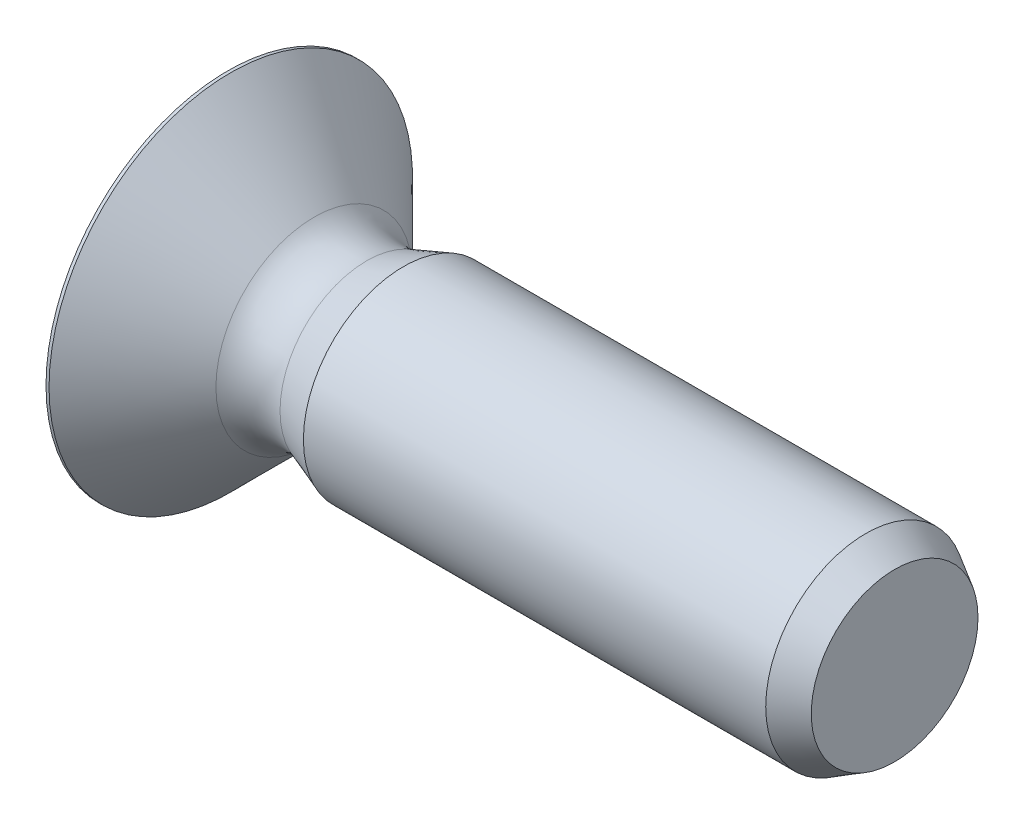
ISO-10303-21;
HEADER;
FILE_DESCRIPTION(('STEP AP214'),'2;1');
FILE_NAME('part.step','',(''),(''),'','','');
FILE_SCHEMA(('AUTOMOTIVE_DESIGN { 1 0 10303 214 1 1 1 1 }'));
ENDSEC;
DATA;
#1=APPLICATION_CONTEXT('core data for automotive mechanical design processes');
#2=APPLICATION_PROTOCOL_DEFINITION('international standard','automotive_design',2000,#1);
#3=PRODUCT_CONTEXT('',#1,'mechanical');
#4=PRODUCT('Part','Part','',(#3));
#5=PRODUCT_RELATED_PRODUCT_CATEGORY('part','',(#4));
#6=PRODUCT_DEFINITION_FORMATION('','',#4);
#7=PRODUCT_DEFINITION_CONTEXT('part definition',#1,'design');
#8=PRODUCT_DEFINITION('design','',#6,#7);
#9=PRODUCT_DEFINITION_SHAPE('','',#8);
#10=(LENGTH_UNIT() NAMED_UNIT(*) SI_UNIT(.MILLI.,.METRE.));
#11=(NAMED_UNIT(*) PLANE_ANGLE_UNIT() SI_UNIT($,.RADIAN.));
#12=(NAMED_UNIT(*) SI_UNIT($,.STERADIAN.) SOLID_ANGLE_UNIT());
#13=UNCERTAINTY_MEASURE_WITH_UNIT(LENGTH_MEASURE(1.E-05),#10,'distance_accuracy_value','');
#14=(GEOMETRIC_REPRESENTATION_CONTEXT(3) GLOBAL_UNCERTAINTY_ASSIGNED_CONTEXT((#13)) GLOBAL_UNIT_ASSIGNED_CONTEXT((#10,
#11,#12)) REPRESENTATION_CONTEXT('',''));
#15=CARTESIAN_POINT('',(0.,0.,0.));
#16=DIRECTION('',(0.,0.,1.));
#17=DIRECTION('',(1.,0.,0.));
#18=AXIS2_PLACEMENT_3D('',#15,#16,#17);
#19=CARTESIAN_POINT('',(-38.1054061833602,0.,0.));
#20=DIRECTION('',(-1.,0.,0.));
#21=DIRECTION('',(0.,0.,1.));
#22=AXIS2_PLACEMENT_3D('',#19,#20,#21);
#23=CYLINDRICAL_SURFACE('',#22,3.00000000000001);
#24=CARTESIAN_POINT('',(6.57794046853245,0.,0.));
#25=DIRECTION('',(-1.,0.,0.));
#26=DIRECTION('',(0.,0.,1.));
#27=AXIS2_PLACEMENT_3D('',#24,#25,#26);
#28=CIRCLE('',#27,3.);
#29=CARTESIAN_POINT('',(6.57794046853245,0.,3.));
#30=VERTEX_POINT('',#29);
#31=EDGE_CURVE('E178',#30,#30,#28,.T.);
#32=ORIENTED_EDGE('',*,*,#31,.F.);
#33=EDGE_LOOP('',(#32));
#34=FACE_BOUND('',#33,.T.);
#35=CARTESIAN_POINT('',(20.4429737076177,0.,0.));
#36=DIRECTION('',(1.,0.,0.));
#37=DIRECTION('',(0.,0.,-1.));
#38=AXIS2_PLACEMENT_3D('',#35,#36,#37);
#39=CIRCLE('',#38,3.);
#40=CARTESIAN_POINT('',(20.4429737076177,0.,-3.));
#41=VERTEX_POINT('',#40);
#42=EDGE_CURVE('E224',#41,#41,#39,.T.);
#43=ORIENTED_EDGE('',*,*,#42,.F.);
#44=EDGE_LOOP('',(#43));
#45=FACE_BOUND('',#44,.T.);
#46=ADVANCED_FACE('F47',(#34,#45),#23,.T.);
#47=CARTESIAN_POINT('',(6.57794046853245,0.,0.));
#48=DIRECTION('',(1.,0.,0.));
#49=DIRECTION('',(0.,0.,-1.));
#50=AXIS2_PLACEMENT_3D('',#47,#48,#49);
#51=CONICAL_SURFACE('',#50,3.,0.349065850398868);
#52=CARTESIAN_POINT('',(5.47591580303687,0.,0.));
#53=DIRECTION('',(1.,0.,0.));
#54=DIRECTION('',(0.,0.,-1.));
#55=AXIS2_PLACEMENT_3D('',#52,#53,#54);
#56=CIRCLE('',#55,2.59889582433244);
#57=CARTESIAN_POINT('',(5.47591580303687,0.,-2.59889582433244));
#58=VERTEX_POINT('',#57);
#59=EDGE_CURVE('E11',#58,#58,#56,.T.);
#60=ORIENTED_EDGE('',*,*,#59,.T.);
#61=EDGE_LOOP('',(#60));
#62=FACE_BOUND('',#61,.T.);
#63=ORIENTED_EDGE('',*,*,#31,.T.);
#64=EDGE_LOOP('',(#63));
#65=FACE_BOUND('',#64,.T.);
#66=ADVANCED_FACE('F249',(#62,#65),#51,.T.);
#67=CARTESIAN_POINT('',(4.57794046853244,0.,0.));
#68=DIRECTION('',(-1.,0.,0.));
#69=DIRECTION('',(0.,0.,1.));
#70=AXIS2_PLACEMENT_3D('',#67,#68,#69);
#71=CONICAL_SURFACE('',#70,2.27205953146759,0.785398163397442);
#72=CARTESIAN_POINT('',(3.90222541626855,0.,0.));
#73=DIRECTION('',(-1.,0.,0.));
#74=DIRECTION('',(0.,0.,1.));
#75=AXIS2_PLACEMENT_3D('',#72,#73,#74);
#76=CIRCLE('',#75,2.94777458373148);
#77=CARTESIAN_POINT('',(3.90222541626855,0.,2.94777458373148));
#78=VERTEX_POINT('',#77);
#79=EDGE_CURVE('E56',#78,#78,#76,.T.);
#80=ORIENTED_EDGE('',*,*,#79,.T.);
#81=EDGE_LOOP('',(#80));
#82=FACE_BOUND('',#81,.T.);
#83=CARTESIAN_POINT('',(1.4,0.,0.));
#84=DIRECTION('',(-1.,0.,0.));
#85=DIRECTION('',(0.,0.,1.));
#86=AXIS2_PLACEMENT_3D('',#83,#84,#85);
#87=CIRCLE('',#86,5.45);
#88=CARTESIAN_POINT('',(1.4,0.,5.45));
#89=VERTEX_POINT('',#88);
#90=EDGE_CURVE('E324',#89,#89,#87,.T.);
#91=ORIENTED_EDGE('',*,*,#90,.F.);
#92=EDGE_LOOP('',(#91));
#93=FACE_BOUND('',#92,.T.);
#94=ADVANCED_FACE('F234',(#82,#93),#71,.T.);
#95=CARTESIAN_POINT('',(-38.1054061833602,0.,0.));
#96=DIRECTION('',(-1.,0.,0.));
#97=DIRECTION('',(0.,0.,1.));
#98=AXIS2_PLACEMENT_3D('',#95,#96,#97);
#99=CYLINDRICAL_SURFACE('',#98,5.45);
#100=CARTESIAN_POINT('',(1.30899911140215,0.,0.));
#101=DIRECTION('',(-1.,0.,0.));
#102=DIRECTION('',(0.,0.,1.));
#103=AXIS2_PLACEMENT_3D('',#100,#101,#102);
#104=CIRCLE('',#103,5.45);
#105=CARTESIAN_POINT('',(1.30899911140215,0.,5.45));
#106=VERTEX_POINT('',#105);
#107=EDGE_CURVE('E321',#106,#106,#104,.T.);
#108=ORIENTED_EDGE('',*,*,#107,.F.);
#109=EDGE_LOOP('',(#108));
#110=FACE_BOUND('',#109,.T.);
#111=ORIENTED_EDGE('',*,*,#90,.T.);
#112=EDGE_LOOP('',(#111));
#113=FACE_BOUND('',#112,.T.);
#114=ADVANCED_FACE('F333',(#110,#113),#99,.T.);
#115=CARTESIAN_POINT('',(12.,0.,0.));
#116=DIRECTION('',(-1.,0.,0.));
#117=DIRECTION('',(0.,1.,0.));
#118=AXIS2_PLACEMENT_3D('',#115,#116,#117);
#119=SPHERICAL_SURFACE('',#118,12.);
#120=CARTESIAN_POINT('',(12.,0.729999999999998,0.));
#121=DIRECTION('',(0.,1.,0.));
#122=DIRECTION('',(0.,0.,1.));
#123=AXIS2_PLACEMENT_3D('',#120,#121,#122);
#124=CIRCLE('',#123,11.977775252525);
#125=CARTESIAN_POINT('',(0.455948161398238,0.729999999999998,-3.19405183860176));
#126=VERTEX_POINT('',#125);
#127=CARTESIAN_POINT('',(0.0444908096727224,0.729999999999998,-0.73));
#128=VERTEX_POINT('',#127);
#129=EDGE_CURVE('E177',#126,#128,#124,.T.);
#130=ORIENTED_EDGE('',*,*,#129,.T.);
#131=CARTESIAN_POINT('',(12.,0.,-0.73));
#132=DIRECTION('',(0.,0.,-1.));
#133=DIRECTION('',(0.,1.,0.));
#134=AXIS2_PLACEMENT_3D('',#131,#132,#133);
#135=CIRCLE('',#134,11.977775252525);
#136=CARTESIAN_POINT('',(0.455948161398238,3.19405183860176,-0.729999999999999));
#137=VERTEX_POINT('',#136);
#138=EDGE_CURVE('E182',#128,#137,#135,.T.);
#139=ORIENTED_EDGE('',*,*,#138,.T.);
#140=CARTESIAN_POINT('',(7.82499999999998,-4.17500000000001,0.));
#141=DIRECTION('',(-0.707106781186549,-0.707106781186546,0.));
#142=DIRECTION('',(0.707106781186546,-0.707106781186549,0.));
#143=AXIS2_PLACEMENT_3D('',#140,#141,#142);
#144=CIRCLE('',#143,10.44694931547);
#145=CARTESIAN_POINT('',(0.455948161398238,3.19405183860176,0.729999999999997));
#146=VERTEX_POINT('',#145);
#147=EDGE_CURVE('E185',#137,#146,#144,.F.);
#148=ORIENTED_EDGE('',*,*,#147,.T.);
#149=CARTESIAN_POINT('',(12.,0.,0.73));
#150=DIRECTION('',(0.,0.,1.));
#151=DIRECTION('',(0.,-1.,0.));
#152=AXIS2_PLACEMENT_3D('',#149,#150,#151);
#153=CIRCLE('',#152,11.977775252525);
#154=CARTESIAN_POINT('',(0.0444908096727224,0.729999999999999,0.73));
#155=VERTEX_POINT('',#154);
#156=EDGE_CURVE('E186',#146,#155,#153,.T.);
#157=ORIENTED_EDGE('',*,*,#156,.T.);
#158=CARTESIAN_POINT('',(12.,0.729999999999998,0.));
#159=DIRECTION('',(0.,1.,0.));
#160=DIRECTION('',(0.,0.,1.));
#161=AXIS2_PLACEMENT_3D('',#158,#159,#160);
#162=CIRCLE('',#161,11.977775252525);
#163=CARTESIAN_POINT('',(0.45594816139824,0.729999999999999,3.19405183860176));
#164=VERTEX_POINT('',#163);
#165=EDGE_CURVE('E167',#155,#164,#162,.T.);
#166=ORIENTED_EDGE('',*,*,#165,.T.);
#167=CARTESIAN_POINT('',(7.82499999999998,0.,-4.17500000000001));
#168=DIRECTION('',(-0.707106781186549,0.,-0.707106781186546));
#169=DIRECTION('',(-0.707106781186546,0.,0.707106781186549));
#170=AXIS2_PLACEMENT_3D('',#167,#168,#169);
#171=CIRCLE('',#170,10.44694931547);
#172=CARTESIAN_POINT('',(0.455948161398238,-0.729999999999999,3.19405183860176));
#173=VERTEX_POINT('',#172);
#174=EDGE_CURVE('E165',#164,#173,#171,.F.);
#175=ORIENTED_EDGE('',*,*,#174,.T.);
#176=CARTESIAN_POINT('',(12.,-0.729999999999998,0.));
#177=DIRECTION('',(0.,-1.,0.));
#178=DIRECTION('',(0.,0.,-1.));
#179=AXIS2_PLACEMENT_3D('',#176,#177,#178);
#180=CIRCLE('',#179,11.977775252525);
#181=CARTESIAN_POINT('',(0.0444908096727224,-0.729999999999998,0.73));
#182=VERTEX_POINT('',#181);
#183=EDGE_CURVE('E149',#173,#182,#180,.T.);
#184=ORIENTED_EDGE('',*,*,#183,.T.);
#185=CARTESIAN_POINT('',(12.,0.,0.73));
#186=DIRECTION('',(0.,0.,1.));
#187=DIRECTION('',(0.,-1.,0.));
#188=AXIS2_PLACEMENT_3D('',#185,#186,#187);
#189=CIRCLE('',#188,11.977775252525);
#190=CARTESIAN_POINT('',(0.455948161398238,-3.19405183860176,0.729999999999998));
#191=VERTEX_POINT('',#190);
#192=EDGE_CURVE('E139',#182,#191,#189,.T.);
#193=ORIENTED_EDGE('',*,*,#192,.T.);
#194=CARTESIAN_POINT('',(7.82499999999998,4.17500000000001,0.));
#195=DIRECTION('',(-0.707106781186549,0.707106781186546,0.));
#196=DIRECTION('',(-0.707106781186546,-0.707106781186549,0.));
#197=AXIS2_PLACEMENT_3D('',#194,#195,#196);
#198=CIRCLE('',#197,10.44694931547);
#199=CARTESIAN_POINT('',(0.455948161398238,-3.19405183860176,-0.729999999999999));
#200=VERTEX_POINT('',#199);
#201=EDGE_CURVE('E150',#191,#200,#198,.F.);
#202=ORIENTED_EDGE('',*,*,#201,.T.);
#203=CARTESIAN_POINT('',(12.,0.,-0.73));
#204=DIRECTION('',(0.,0.,-1.));
#205=DIRECTION('',(0.,1.,0.));
#206=AXIS2_PLACEMENT_3D('',#203,#204,#205);
#207=CIRCLE('',#206,11.977775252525);
#208=CARTESIAN_POINT('',(0.0444908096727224,-0.729999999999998,-0.73));
#209=VERTEX_POINT('',#208);
#210=EDGE_CURVE('E175',#200,#209,#207,.T.);
#211=ORIENTED_EDGE('',*,*,#210,.T.);
#212=CARTESIAN_POINT('',(12.,-0.729999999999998,0.));
#213=DIRECTION('',(0.,-1.,0.));
#214=DIRECTION('',(0.,0.,-1.));
#215=AXIS2_PLACEMENT_3D('',#212,#213,#214);
#216=CIRCLE('',#215,11.977775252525);
#217=CARTESIAN_POINT('',(0.455948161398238,-0.729999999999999,-3.19405183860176));
#218=VERTEX_POINT('',#217);
#219=EDGE_CURVE('E172',#209,#218,#216,.T.);
#220=ORIENTED_EDGE('',*,*,#219,.T.);
#221=CARTESIAN_POINT('',(7.82499999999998,0.,4.17500000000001));
#222=DIRECTION('',(-0.707106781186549,0.,0.707106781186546));
#223=DIRECTION('',(0.707106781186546,0.,0.707106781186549));
#224=AXIS2_PLACEMENT_3D('',#221,#222,#223);
#225=CIRCLE('',#224,10.44694931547);
#226=EDGE_CURVE('E176',#218,#126,#225,.F.);
#227=ORIENTED_EDGE('',*,*,#226,.T.);
#228=EDGE_LOOP('',(#130,#139,#148,#157,#166,#175,#184,#193,#202,#211,#220,#227));
#229=FACE_BOUND('',#228,.T.);
#230=ORIENTED_EDGE('',*,*,#107,.T.);
#231=EDGE_LOOP('',(#230));
#232=FACE_BOUND('',#231,.T.);
#233=ADVANCED_FACE('F162',(#229,#232),#119,.T.);
#234=CARTESIAN_POINT('',(21.3089991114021,0.,0.));
#235=DIRECTION('',(-1.,0.,0.));
#236=DIRECTION('',(0.,0.,1.));
#237=AXIS2_PLACEMENT_3D('',#234,#235,#236);
#238=CONICAL_SURFACE('',#237,2.5,0.523598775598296);
#239=ORIENTED_EDGE('',*,*,#42,.T.);
#240=EDGE_LOOP('',(#239));
#241=FACE_BOUND('',#240,.T.);
#242=CARTESIAN_POINT('',(21.3089991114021,0.,0.));
#243=DIRECTION('',(1.,0.,0.));
#244=DIRECTION('',(0.,0.,-1.));
#245=AXIS2_PLACEMENT_3D('',#242,#243,#244);
#246=CIRCLE('',#245,2.5);
#247=CARTESIAN_POINT('',(21.3089991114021,0.,-2.5));
#248=VERTEX_POINT('',#247);
#249=EDGE_CURVE('E318',#248,#248,#246,.T.);
#250=ORIENTED_EDGE('',*,*,#249,.F.);
#251=EDGE_LOOP('',(#250));
#252=FACE_BOUND('',#251,.T.);
#253=ADVANCED_FACE('F265',(#241,#252),#238,.T.);
#254=CARTESIAN_POINT('',(21.3089991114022,0.,0.));
#255=DIRECTION('',(-1.,0.,0.));
#256=DIRECTION('',(0.,0.,1.));
#257=AXIS2_PLACEMENT_3D('',#254,#255,#256);
#258=PLANE('',#257);
#259=ORIENTED_EDGE('',*,*,#249,.T.);
#260=EDGE_LOOP('',(#259));
#261=FACE_BOUND('',#260,.T.);
#262=ADVANCED_FACE('F261',(#261),#258,.F.);
#263=CARTESIAN_POINT('',(2.725,3.65,-0.729999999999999));
#264=DIRECTION('',(0.,0.,-1.));
#265=DIRECTION('',(0.,1.,0.));
#266=AXIS2_PLACEMENT_3D('',#263,#264,#265);
#267=PLANE('',#266);
#268=DIRECTION('',(-1.,0.,0.));
#269=VECTOR('',#268,1.);
#270=CARTESIAN_POINT('',(2.725,0.729999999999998,-0.73));
#271=LINE('',#270,#269);
#272=CARTESIAN_POINT('',(2.725,0.729999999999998,-0.73));
#273=VERTEX_POINT('',#272);
#274=EDGE_CURVE('E64',#273,#128,#271,.T.);
#275=ORIENTED_EDGE('',*,*,#274,.F.);
#276=DIRECTION('',(0.,-1.,0.));
#277=VECTOR('',#276,1.);
#278=CARTESIAN_POINT('',(2.725,3.65,-0.729999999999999));
#279=LINE('',#278,#277);
#280=CARTESIAN_POINT('',(2.725,0.92499999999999,-0.73));
#281=VERTEX_POINT('',#280);
#282=EDGE_CURVE('E303',#281,#273,#279,.T.);
#283=ORIENTED_EDGE('',*,*,#282,.F.);
#284=DIRECTION('',(0.707106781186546,-0.707106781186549,0.));
#285=VECTOR('',#284,1.);
#286=CARTESIAN_POINT('',(0.,3.65,-0.729999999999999));
#287=LINE('',#286,#285);
#288=EDGE_CURVE('E221',#281,#137,#287,.F.);
#289=ORIENTED_EDGE('',*,*,#288,.T.);
#290=ORIENTED_EDGE('',*,*,#138,.F.);
#291=EDGE_LOOP('',(#275,#283,#289,#290));
#292=FACE_BOUND('',#291,.T.);
#293=ADVANCED_FACE('F264',(#292),#267,.F.);
#294=CARTESIAN_POINT('',(0.,3.65,0.));
#295=DIRECTION('',(-0.707106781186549,-0.707106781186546,0.));
#296=DIRECTION('',(0.707106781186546,-0.707106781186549,0.));
#297=AXIS2_PLACEMENT_3D('',#294,#295,#296);
#298=PLANE('',#297);
#299=ORIENTED_EDGE('',*,*,#288,.F.);
#300=DIRECTION('',(0.,0.,1.));
#301=VECTOR('',#300,1.);
#302=CARTESIAN_POINT('',(2.725,0.92499999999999,-0.730000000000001));
#303=LINE('',#302,#301);
#304=CARTESIAN_POINT('',(2.725,0.924999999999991,0.729999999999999));
#305=VERTEX_POINT('',#304);
#306=EDGE_CURVE('E228',#305,#281,#303,.F.);
#307=ORIENTED_EDGE('',*,*,#306,.F.);
#308=DIRECTION('',(0.707106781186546,-0.707106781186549,0.));
#309=VECTOR('',#308,1.);
#310=CARTESIAN_POINT('',(1.3625,2.2875,0.729999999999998));
#311=LINE('',#310,#309);
#312=EDGE_CURVE('E120',#305,#146,#311,.F.);
#313=ORIENTED_EDGE('',*,*,#312,.T.);
#314=ORIENTED_EDGE('',*,*,#147,.F.);
#315=EDGE_LOOP('',(#299,#307,#313,#314));
#316=FACE_BOUND('',#315,.T.);
#317=ADVANCED_FACE('F272',(#316),#298,.T.);
#318=CARTESIAN_POINT('',(2.725,3.65,0.729999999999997));
#319=DIRECTION('',(0.,0.,1.));
#320=DIRECTION('',(0.,-1.,0.));
#321=AXIS2_PLACEMENT_3D('',#318,#319,#320);
#322=PLANE('',#321);
#323=ORIENTED_EDGE('',*,*,#312,.F.);
#324=DIRECTION('',(0.,1.,0.));
#325=VECTOR('',#324,1.);
#326=CARTESIAN_POINT('',(2.725,3.65,0.729999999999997));
#327=LINE('',#326,#325);
#328=CARTESIAN_POINT('',(2.725,0.729999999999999,0.73));
#329=VERTEX_POINT('',#328);
#330=EDGE_CURVE('E230',#329,#305,#327,.T.);
#331=ORIENTED_EDGE('',*,*,#330,.F.);
#332=DIRECTION('',(-1.,0.,0.));
#333=VECTOR('',#332,1.);
#334=CARTESIAN_POINT('',(2.725,0.729999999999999,0.73));
#335=LINE('',#334,#333);
#336=EDGE_CURVE('E129',#329,#155,#335,.T.);
#337=ORIENTED_EDGE('',*,*,#336,.T.);
#338=ORIENTED_EDGE('',*,*,#156,.F.);
#339=EDGE_LOOP('',(#323,#331,#337,#338));
#340=FACE_BOUND('',#339,.T.);
#341=ADVANCED_FACE('F275',(#340),#322,.F.);
#342=CARTESIAN_POINT('',(2.725,0.729999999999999,0.73));
#343=DIRECTION('',(0.,1.,0.));
#344=DIRECTION('',(0.,0.,1.));
#345=AXIS2_PLACEMENT_3D('',#342,#343,#344);
#346=PLANE('',#345);
#347=ORIENTED_EDGE('',*,*,#336,.F.);
#348=DIRECTION('',(0.,0.,-1.));
#349=VECTOR('',#348,1.);
#350=CARTESIAN_POINT('',(2.725,0.729999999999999,0.73));
#351=LINE('',#350,#349);
#352=CARTESIAN_POINT('',(2.725,0.729999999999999,0.924999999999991));
#353=VERTEX_POINT('',#352);
#354=EDGE_CURVE('E196',#353,#329,#351,.T.);
#355=ORIENTED_EDGE('',*,*,#354,.F.);
#356=DIRECTION('',(0.707106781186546,0.,-0.707106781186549));
#357=VECTOR('',#356,1.);
#358=CARTESIAN_POINT('',(0.,0.73,3.65));
#359=LINE('',#358,#357);
#360=EDGE_CURVE('E189',#353,#164,#359,.F.);
#361=ORIENTED_EDGE('',*,*,#360,.T.);
#362=ORIENTED_EDGE('',*,*,#165,.F.);
#363=EDGE_LOOP('',(#347,#355,#361,#362));
#364=FACE_BOUND('',#363,.T.);
#365=ADVANCED_FACE('F270',(#364),#346,.F.);
#366=CARTESIAN_POINT('',(0.,0.,3.65));
#367=DIRECTION('',(-0.707106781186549,0.,-0.707106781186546));
#368=DIRECTION('',(-0.707106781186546,0.,0.707106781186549));
#369=AXIS2_PLACEMENT_3D('',#366,#367,#368);
#370=PLANE('',#369);
#371=ORIENTED_EDGE('',*,*,#360,.F.);
#372=DIRECTION('',(0.,-1.,0.));
#373=VECTOR('',#372,1.);
#374=CARTESIAN_POINT('',(2.725,-0.729999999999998,0.924999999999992));
#375=LINE('',#374,#373);
#376=CARTESIAN_POINT('',(2.725,-0.729999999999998,0.924999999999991));
#377=VERTEX_POINT('',#376);
#378=EDGE_CURVE('E193',#377,#353,#375,.F.);
#379=ORIENTED_EDGE('',*,*,#378,.F.);
#380=DIRECTION('',(0.707106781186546,0.,-0.707106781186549));
#381=VECTOR('',#380,1.);
#382=CARTESIAN_POINT('',(2.8225,-0.729999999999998,0.827499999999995));
#383=LINE('',#382,#381);
#384=EDGE_CURVE('E158',#377,#173,#383,.F.);
#385=ORIENTED_EDGE('',*,*,#384,.T.);
#386=ORIENTED_EDGE('',*,*,#174,.F.);
#387=EDGE_LOOP('',(#371,#379,#385,#386));
#388=FACE_BOUND('',#387,.T.);
#389=ADVANCED_FACE('F267',(#388),#370,.T.);
#390=CARTESIAN_POINT('',(2.725,-0.729999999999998,0.73));
#391=DIRECTION('',(0.,-1.,0.));
#392=DIRECTION('',(0.,0.,-1.));
#393=AXIS2_PLACEMENT_3D('',#390,#391,#392);
#394=PLANE('',#393);
#395=ORIENTED_EDGE('',*,*,#384,.F.);
#396=DIRECTION('',(0.,0.,1.));
#397=VECTOR('',#396,1.);
#398=CARTESIAN_POINT('',(2.725,-0.729999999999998,0.73));
#399=LINE('',#398,#397);
#400=CARTESIAN_POINT('',(2.725,-0.729999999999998,0.73));
#401=VERTEX_POINT('',#400);
#402=EDGE_CURVE('E156',#401,#377,#399,.T.);
#403=ORIENTED_EDGE('',*,*,#402,.F.);
#404=DIRECTION('',(-1.,0.,0.));
#405=VECTOR('',#404,1.);
#406=CARTESIAN_POINT('',(2.725,-0.729999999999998,0.73));
#407=LINE('',#406,#405);
#408=EDGE_CURVE('E143',#401,#182,#407,.T.);
#409=ORIENTED_EDGE('',*,*,#408,.T.);
#410=ORIENTED_EDGE('',*,*,#183,.F.);
#411=EDGE_LOOP('',(#395,#403,#409,#410));
#412=FACE_BOUND('',#411,.T.);
#413=ADVANCED_FACE('F153',(#412),#394,.F.);
#414=CARTESIAN_POINT('',(2.725,-3.65,0.729999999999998));
#415=DIRECTION('',(0.,0.,1.));
#416=DIRECTION('',(0.,-1.,0.));
#417=AXIS2_PLACEMENT_3D('',#414,#415,#416);
#418=PLANE('',#417);
#419=ORIENTED_EDGE('',*,*,#408,.F.);
#420=DIRECTION('',(0.,1.,0.));
#421=VECTOR('',#420,1.);
#422=CARTESIAN_POINT('',(2.725,-3.65,0.729999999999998));
#423=LINE('',#422,#421);
#424=CARTESIAN_POINT('',(2.725,-0.92499999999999,0.73));
#425=VERTEX_POINT('',#424);
#426=EDGE_CURVE('E219',#425,#401,#423,.T.);
#427=ORIENTED_EDGE('',*,*,#426,.F.);
#428=DIRECTION('',(0.707106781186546,0.707106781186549,0.));
#429=VECTOR('',#428,1.);
#430=CARTESIAN_POINT('',(0.,-3.65,0.729999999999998));
#431=LINE('',#430,#429);
#432=EDGE_CURVE('E145',#425,#191,#431,.F.);
#433=ORIENTED_EDGE('',*,*,#432,.T.);
#434=ORIENTED_EDGE('',*,*,#192,.F.);
#435=EDGE_LOOP('',(#419,#427,#433,#434));
#436=FACE_BOUND('',#435,.T.);
#437=ADVANCED_FACE('F141',(#436),#418,.F.);
#438=CARTESIAN_POINT('',(0.,-3.65,0.));
#439=DIRECTION('',(-0.707106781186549,0.707106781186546,0.));
#440=DIRECTION('',(-0.707106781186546,-0.707106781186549,0.));
#441=AXIS2_PLACEMENT_3D('',#438,#439,#440);
#442=PLANE('',#441);
#443=ORIENTED_EDGE('',*,*,#432,.F.);
#444=DIRECTION('',(0.,0.,-1.));
#445=VECTOR('',#444,1.);
#446=CARTESIAN_POINT('',(2.725,-0.924999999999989,-0.73));
#447=LINE('',#446,#445);
#448=CARTESIAN_POINT('',(2.725,-0.924999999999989,-0.73));
#449=VERTEX_POINT('',#448);
#450=EDGE_CURVE('E216',#449,#425,#447,.F.);
#451=ORIENTED_EDGE('',*,*,#450,.F.);
#452=DIRECTION('',(0.707106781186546,0.707106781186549,0.));
#453=VECTOR('',#452,1.);
#454=CARTESIAN_POINT('',(1.36249999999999,-2.2875,-0.729999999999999));
#455=LINE('',#454,#453);
#456=EDGE_CURVE('E212',#449,#200,#455,.F.);
#457=ORIENTED_EDGE('',*,*,#456,.T.);
#458=ORIENTED_EDGE('',*,*,#201,.F.);
#459=EDGE_LOOP('',(#443,#451,#457,#458));
#460=FACE_BOUND('',#459,.T.);
#461=ADVANCED_FACE('F277',(#460),#442,.T.);
#462=CARTESIAN_POINT('',(2.725,-3.65,-0.729999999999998));
#463=DIRECTION('',(0.,0.,-1.));
#464=DIRECTION('',(0.,1.,0.));
#465=AXIS2_PLACEMENT_3D('',#462,#463,#464);
#466=PLANE('',#465);
#467=ORIENTED_EDGE('',*,*,#456,.F.);
#468=DIRECTION('',(0.,-1.,0.));
#469=VECTOR('',#468,1.);
#470=CARTESIAN_POINT('',(2.725,-3.65,-0.729999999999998));
#471=LINE('',#470,#469);
#472=CARTESIAN_POINT('',(2.725,-0.729999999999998,-0.73));
#473=VERTEX_POINT('',#472);
#474=EDGE_CURVE('E220',#473,#449,#471,.T.);
#475=ORIENTED_EDGE('',*,*,#474,.F.);
#476=DIRECTION('',(-1.,0.,0.));
#477=VECTOR('',#476,1.);
#478=CARTESIAN_POINT('',(2.725,-0.729999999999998,-0.73));
#479=LINE('',#478,#477);
#480=EDGE_CURVE('E200',#473,#209,#479,.T.);
#481=ORIENTED_EDGE('',*,*,#480,.T.);
#482=ORIENTED_EDGE('',*,*,#210,.F.);
#483=EDGE_LOOP('',(#467,#475,#481,#482));
#484=FACE_BOUND('',#483,.T.);
#485=ADVANCED_FACE('F279',(#484),#466,.F.);
#486=CARTESIAN_POINT('',(2.725,-0.729999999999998,-0.73));
#487=DIRECTION('',(0.,-1.,0.));
#488=DIRECTION('',(0.,0.,-1.));
#489=AXIS2_PLACEMENT_3D('',#486,#487,#488);
#490=PLANE('',#489);
#491=ORIENTED_EDGE('',*,*,#480,.F.);
#492=DIRECTION('',(0.,0.,1.));
#493=VECTOR('',#492,1.);
#494=CARTESIAN_POINT('',(2.725,-0.729999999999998,-0.73));
#495=LINE('',#494,#493);
#496=CARTESIAN_POINT('',(2.725,-0.729999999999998,-0.924999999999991));
#497=VERTEX_POINT('',#496);
#498=EDGE_CURVE('E209',#497,#473,#495,.T.);
#499=ORIENTED_EDGE('',*,*,#498,.F.);
#500=DIRECTION('',(0.707106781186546,0.,0.707106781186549));
#501=VECTOR('',#500,1.);
#502=CARTESIAN_POINT('',(0.,-0.729999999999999,-3.65));
#503=LINE('',#502,#501);
#504=EDGE_CURVE('E197',#497,#218,#503,.F.);
#505=ORIENTED_EDGE('',*,*,#504,.T.);
#506=ORIENTED_EDGE('',*,*,#219,.F.);
#507=EDGE_LOOP('',(#491,#499,#505,#506));
#508=FACE_BOUND('',#507,.T.);
#509=ADVANCED_FACE('F283',(#508),#490,.F.);
#510=CARTESIAN_POINT('',(0.,0.,-3.65));
#511=DIRECTION('',(-0.707106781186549,0.,0.707106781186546));
#512=DIRECTION('',(0.707106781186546,0.,0.707106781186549));
#513=AXIS2_PLACEMENT_3D('',#510,#511,#512);
#514=PLANE('',#513);
#515=ORIENTED_EDGE('',*,*,#504,.F.);
#516=DIRECTION('',(0.,1.,0.));
#517=VECTOR('',#516,1.);
#518=CARTESIAN_POINT('',(2.725,-0.729999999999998,-0.924999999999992));
#519=LINE('',#518,#517);
#520=CARTESIAN_POINT('',(2.725,0.729999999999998,-0.924999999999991));
#521=VERTEX_POINT('',#520);
#522=EDGE_CURVE('E206',#521,#497,#519,.F.);
#523=ORIENTED_EDGE('',*,*,#522,.F.);
#524=DIRECTION('',(0.707106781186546,0.,0.707106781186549));
#525=VECTOR('',#524,1.);
#526=CARTESIAN_POINT('',(2.8225,0.729999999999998,-0.827499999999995));
#527=LINE('',#526,#525);
#528=EDGE_CURVE('E201',#521,#126,#527,.F.);
#529=ORIENTED_EDGE('',*,*,#528,.T.);
#530=ORIENTED_EDGE('',*,*,#226,.F.);
#531=EDGE_LOOP('',(#515,#523,#529,#530));
#532=FACE_BOUND('',#531,.T.);
#533=ADVANCED_FACE('F281',(#532),#514,.T.);
#534=CARTESIAN_POINT('',(2.725,0.729999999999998,-0.73));
#535=DIRECTION('',(0.,1.,0.));
#536=DIRECTION('',(0.,0.,1.));
#537=AXIS2_PLACEMENT_3D('',#534,#535,#536);
#538=PLANE('',#537);
#539=ORIENTED_EDGE('',*,*,#528,.F.);
#540=DIRECTION('',(0.,0.,-1.));
#541=VECTOR('',#540,1.);
#542=CARTESIAN_POINT('',(2.725,0.729999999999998,-0.73));
#543=LINE('',#542,#541);
#544=EDGE_CURVE('E210',#273,#521,#543,.T.);
#545=ORIENTED_EDGE('',*,*,#544,.F.);
#546=ORIENTED_EDGE('',*,*,#274,.T.);
#547=ORIENTED_EDGE('',*,*,#129,.F.);
#548=EDGE_LOOP('',(#539,#545,#546,#547));
#549=FACE_BOUND('',#548,.T.);
#550=ADVANCED_FACE('F244',(#549),#538,.F.);
#551=CARTESIAN_POINT('',(2.725,-0.729999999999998,-0.73));
#552=DIRECTION('',(-1.,0.,0.));
#553=DIRECTION('',(0.,0.,1.));
#554=AXIS2_PLACEMENT_3D('',#551,#552,#553);
#555=PLANE('',#554);
#556=ORIENTED_EDGE('',*,*,#282,.T.);
#557=ORIENTED_EDGE('',*,*,#544,.T.);
#558=ORIENTED_EDGE('',*,*,#522,.T.);
#559=ORIENTED_EDGE('',*,*,#498,.T.);
#560=ORIENTED_EDGE('',*,*,#474,.T.);
#561=ORIENTED_EDGE('',*,*,#450,.T.);
#562=ORIENTED_EDGE('',*,*,#426,.T.);
#563=ORIENTED_EDGE('',*,*,#402,.T.);
#564=ORIENTED_EDGE('',*,*,#378,.T.);
#565=ORIENTED_EDGE('',*,*,#354,.T.);
#566=ORIENTED_EDGE('',*,*,#330,.T.);
#567=ORIENTED_EDGE('',*,*,#306,.T.);
#568=EDGE_LOOP('',(#556,#557,#558,#559,#560,#561,#562,#563,#564,#565,#566,#567));
#569=FACE_BOUND('',#568,.T.);
#570=ADVANCED_FACE('F238',(#569),#555,.T.);
#571=CARTESIAN_POINT('',(4.96288558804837,0.,0.));
#572=DIRECTION('',(-1.,0.,0.));
#573=DIRECTION('',(0.,0.,1.));
#574=AXIS2_PLACEMENT_3D('',#571,#572,#573);
#575=TOROIDAL_SURFACE('',#574,4.0084347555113,1.5);
#576=ORIENTED_EDGE('',*,*,#59,.F.);
#577=EDGE_LOOP('',(#576));
#578=FACE_BOUND('',#577,.T.);
#579=ORIENTED_EDGE('',*,*,#79,.F.);
#580=EDGE_LOOP('',(#579));
#581=FACE_BOUND('',#580,.T.);
#582=ADVANCED_FACE('F49',(#578,#581),#575,.F.);
#583=CLOSED_SHELL('',(#46,#66,#94,#114,#233,#253,#262,#293,#317,#341,#365,#389,#413,#437,#461,
#485,#509,#533,#550,#570,#582));
#584=MANIFOLD_SOLID_BREP('B2',#583);
#585=ADVANCED_BREP_SHAPE_REPRESENTATION('',(#18,#584),#14);
#586=SHAPE_DEFINITION_REPRESENTATION(#9,#585);
ENDSEC;
END-ISO-10303-21;
